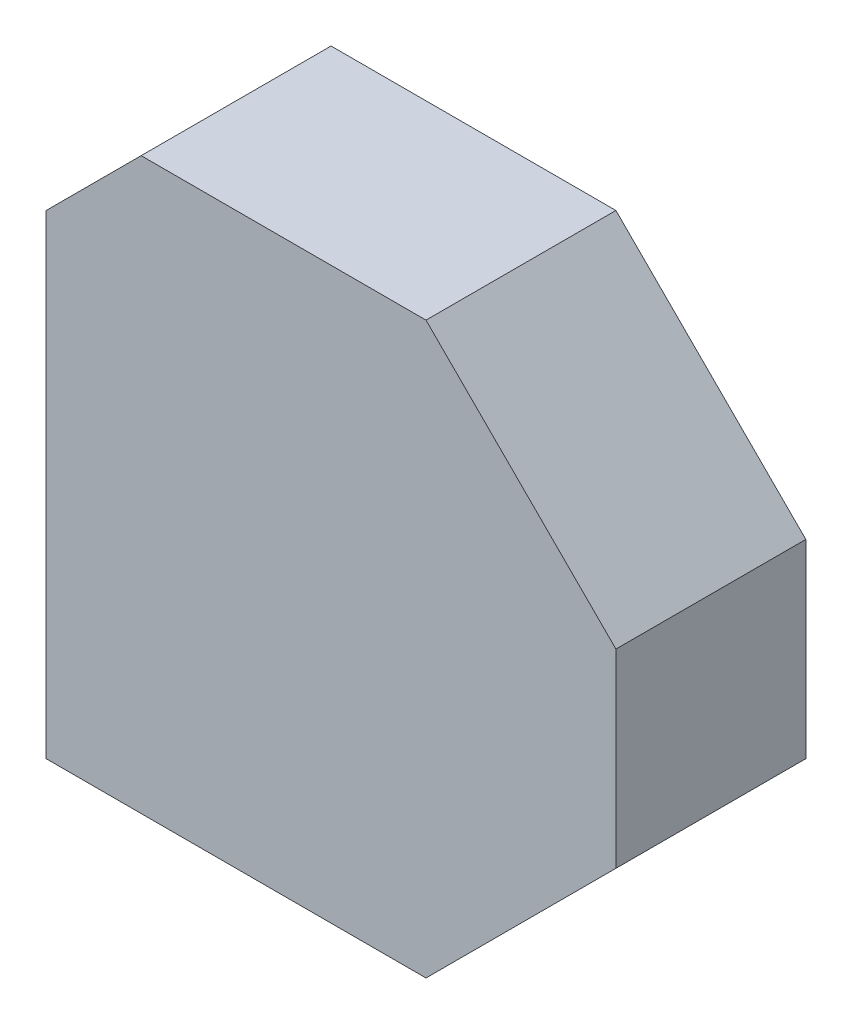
from build123d import *

# Parameters (mm, degrees)
ESQUISSE1_W        = 30
ESQUISSE1_H        = 30
BOSS_EXTRU_1_DEPTH = 10
CHANFREIN1_SIZE    = 10
CHANFREIN2_SIZE    = 5


with BuildPart() as part:
    # Esquisse1 → Boss.-Extru.1 (new body)
    with BuildSketch(Plane.XY):
        with Locations((15, 15)):
            Rectangle(ESQUISSE1_W, ESQUISSE1_H)
    extrude(amount=BOSS_EXTRU_1_DEPTH)

    # Chanfrein1
    chanfrein1_edges = [part.edges().sort_by_distance(p)[0] for p in [
        (30, 30, 5),
        (30, 0, 5),
    ]]
    chamfer(chanfrein1_edges, length=CHANFREIN1_SIZE)

    # Chanfrein2
    chanfrein2_edges = [part.edges().sort_by_distance(p)[0] for p in [
        (0, 30, 5),
    ]]
    chamfer(chanfrein2_edges, length=CHANFREIN2_SIZE)


solid = part.part
